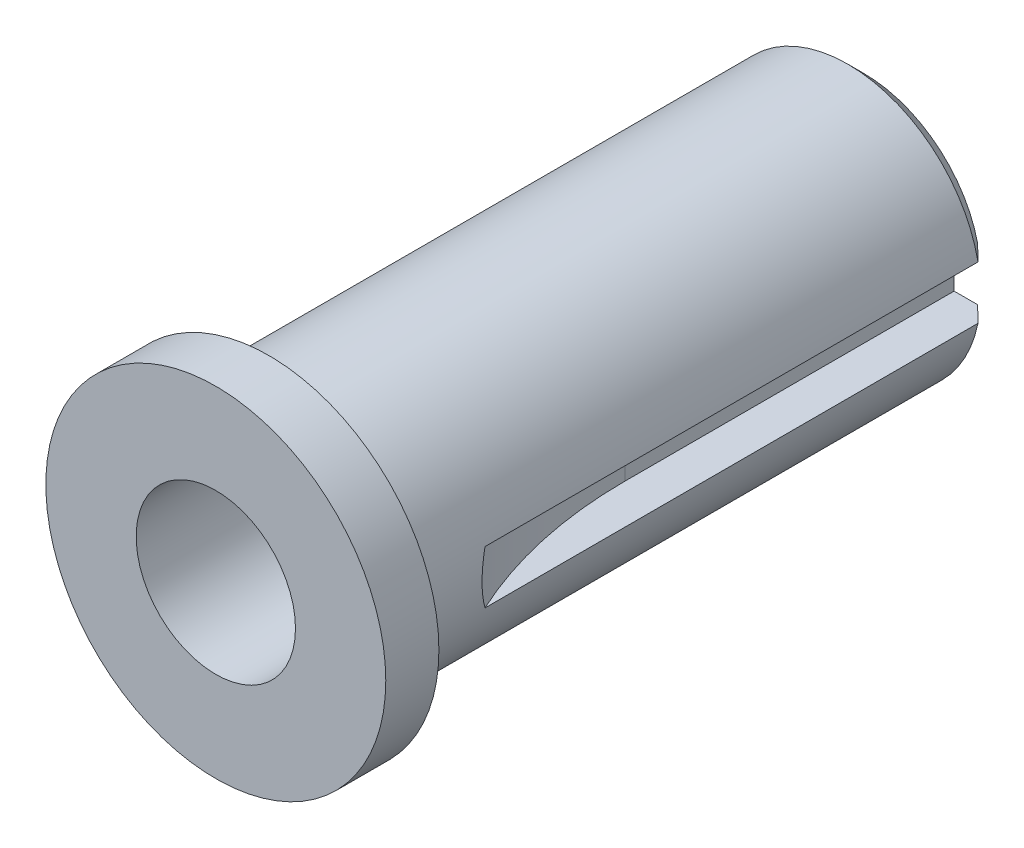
from build123d import *

# Parameters (mm, degrees)
ESQUISSE1_R             = 12.5
BASE_EXTRUSION_DEPTH    = 56
ESQUISSE2_R             = 16
BOSS_EXTRU_1_DEPTH      = 5
ESQUISSE3_R             = 7.5
ENL_V_MAT_EXTRU_1_DEPTH = 36
ESQUISSE4_R             = 5.915
ENL_V_MAT_EXTRU_2_DEPTH = 43.520583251
CHANFREIN1_SIZE         = 1.5
ENL_V_MAT_EXTRU_5_DEPTH = 2.5


with BuildPart() as part:
    # Esquisse1 → Base-Extrusion (new body)
    with BuildSketch(Plane.XY):
        Circle(ESQUISSE1_R)
    extrude(amount=BASE_EXTRUSION_DEPTH)

    # Esquisse2 → Boss.-Extru.1 (add)
    with BuildSketch(Plane.XY.offset(56)):
        Circle(ESQUISSE2_R)
    extrude(amount=BOSS_EXTRU_1_DEPTH)

    # Esquisse3 → Enl_v. mat.-Extru.1 (cut)
    with BuildSketch(Plane.XY.offset(61)):
        Circle(ESQUISSE3_R)
    extrude(amount=-ENL_V_MAT_EXTRU_1_DEPTH, mode=Mode.SUBTRACT)

    # Esquisse4 → Enl_v. mat.-Extru.2 (cut, through all)
    with BuildSketch(Plane.XY.offset(25)):
        Circle(ESQUISSE4_R)
    extrude(amount=-ENL_V_MAT_EXTRU_2_DEPTH, mode=Mode.SUBTRACT)

    # Chanfrein1
    chanfrein1_edges = [part.edges().sort_by_distance(p)[0] for p in [
        (-12.5, 0, 0),
    ]]
    chamfer(chanfrein1_edges, length=CHANFREIN1_SIZE)

    # Esquisse6 → Enl_v. mat.-Extru.5 (cut, symmetric)
    with BuildSketch(Plane(origin=(0, 0, 0), x_dir=(-1, 0, 0), z_dir=(0, -1, 0))):
        with BuildLine():
            Line((-8.5, -31), (-8.5, 85.924133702))
            Line((-8.5, 85.924133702), (-87.063839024, 85.924133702))
            Line((-87.063839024, 85.924133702), (-88.496970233, -30.507686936))
            ThreePointArc((-88.496970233, -30.507686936), (-48.746161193, -70.999242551), (-8.5, -31))
        make_face()
    extrude(amount=ENL_V_MAT_EXTRU_5_DEPTH, both=True, mode=Mode.SUBTRACT)


solid = part.part
